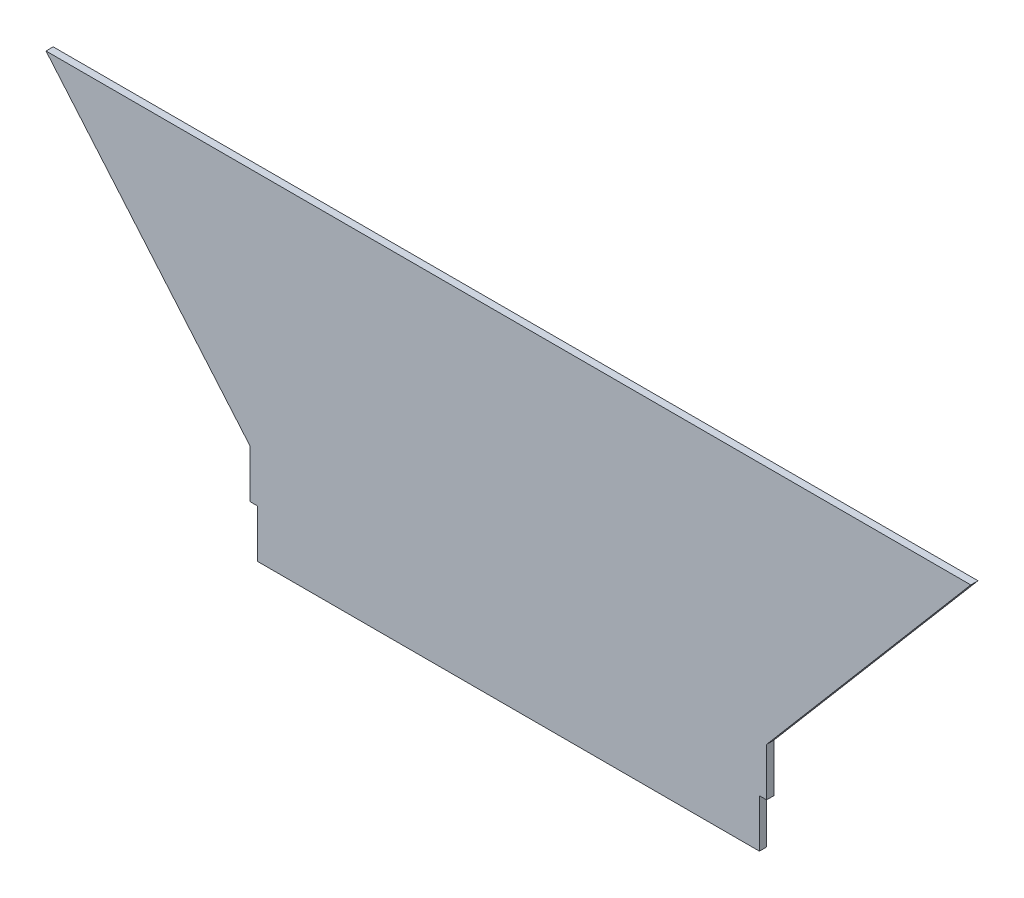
from build123d import *

# Parameters (mm, degrees)
SKETCH_1_W          = 215
SKETCH_1_H          = 140
EXTRUDE_1_DEPTH     = 3
EXTRUDE_3_DEPTH     = 3
SKETCH_5_W          = 3
SKETCH_5_H          = 20
CUT_EXTRUDE_1_DEPTH = 3


with BuildPart() as part:
    # Sketch 1 → Extrude 1 (new body)
    with BuildSketch(Plane.XY):
        Rectangle(SKETCH_1_W, SKETCH_1_H)
    extrude(amount=EXTRUDE_1_DEPTH)

    # Sketch 3 → Extrude 3 (add)
    with BuildSketch(Plane.XY):
        Polygon((-107.5, -30), (-192.5, 70), (192.5, 70), (107.5, -30), align=None)
    extrude(amount=EXTRUDE_3_DEPTH)

    # Sketch 5 → Cut-Extrude 1 (cut)
    with BuildSketch(Plane.XY):
        with Locations((106, -60)):
            Rectangle(SKETCH_5_W, SKETCH_5_H)
        with Locations((-106, -60)):
            Rectangle(SKETCH_5_W, SKETCH_5_H)
    extrude(amount=CUT_EXTRUDE_1_DEPTH, mode=Mode.SUBTRACT)


solid = part.part
